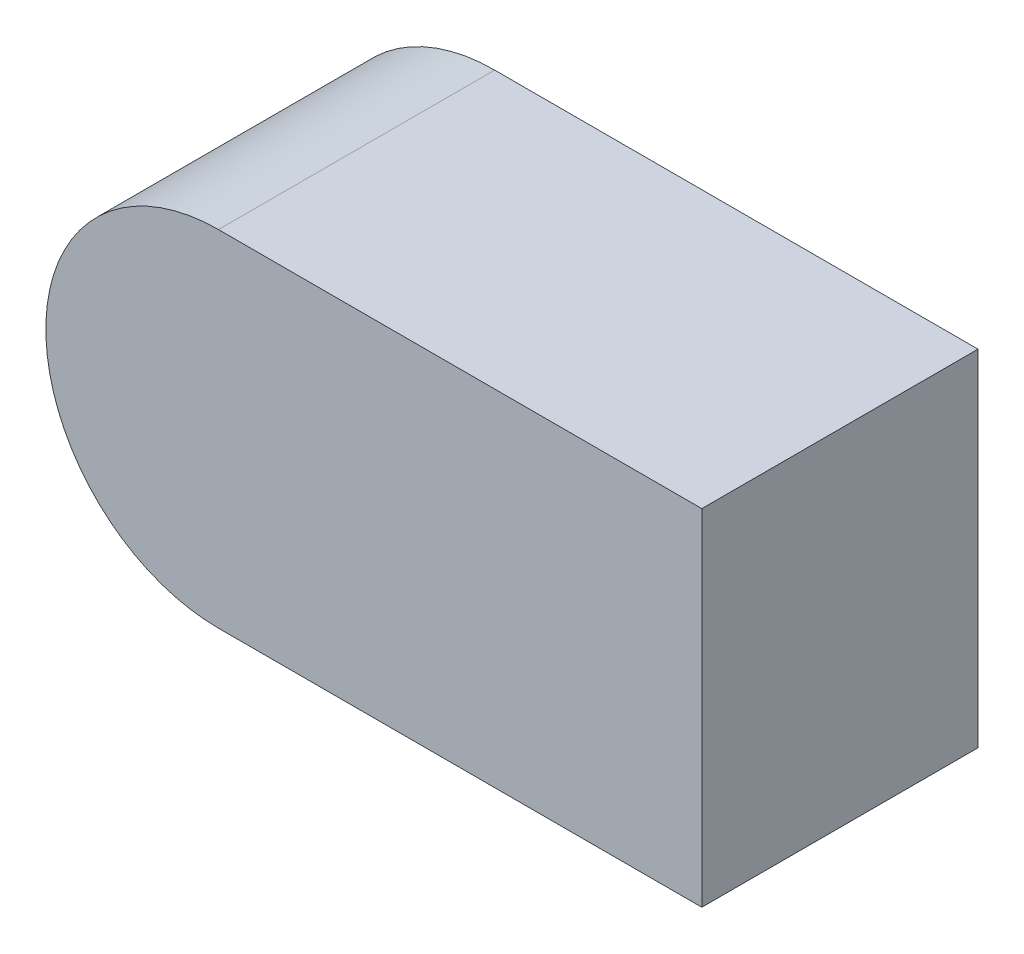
from build123d import *

# Parameters (mm, degrees)
BASE_EXTRUSION_DEPTH = 8


with BuildPart() as part:
    # Esquisse1 → Base-Extrusion (new body)
    with BuildSketch(Plane.XY):
        with BuildLine():
            Line((-7, 5), (7, 5))
            Line((7, 5), (7, -5))
            Line((7, -5), (-7, -5))
            ThreePointArc((-7, -5), (-12, 0), (-7, 5))
        make_face()
    extrude(amount=-BASE_EXTRUSION_DEPTH)


solid = part.part
